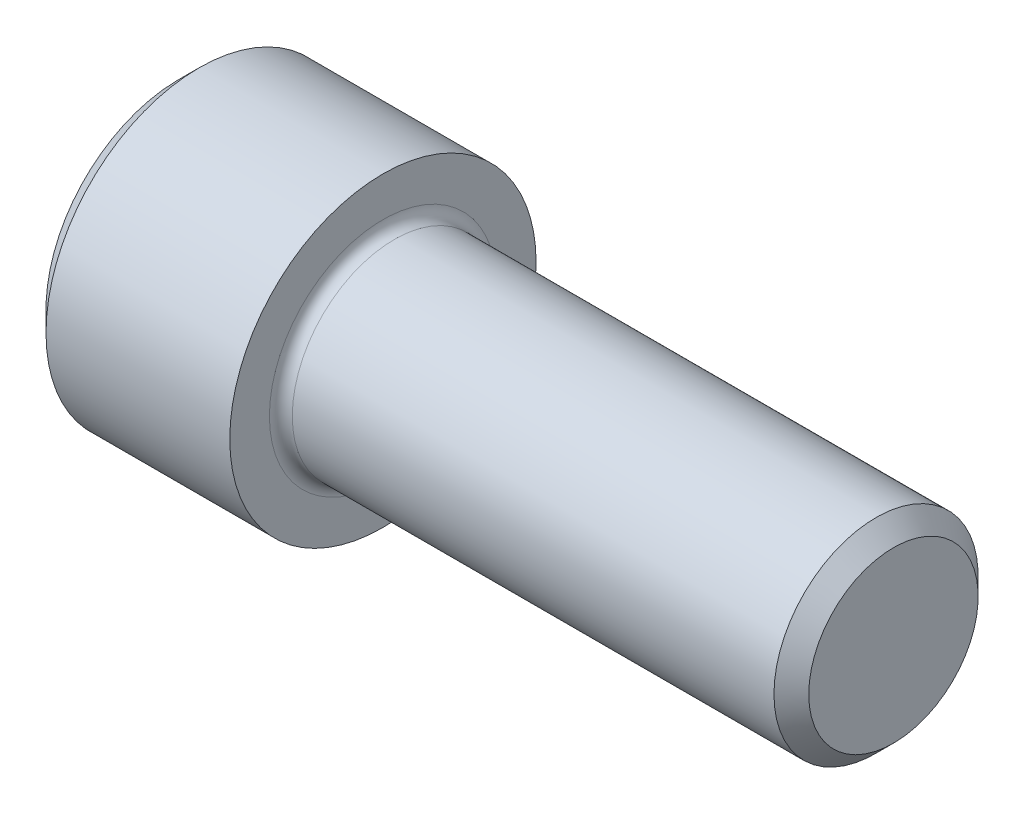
ISO-10303-21;
HEADER;
FILE_DESCRIPTION(('STEP AP214'),'2;1');
FILE_NAME('part.step','',(''),(''),'','','');
FILE_SCHEMA(('AUTOMOTIVE_DESIGN { 1 0 10303 214 1 1 1 1 }'));
ENDSEC;
DATA;
#1=APPLICATION_CONTEXT('core data for automotive mechanical design processes');
#2=APPLICATION_PROTOCOL_DEFINITION('international standard','automotive_design',2000,#1);
#3=PRODUCT_CONTEXT('',#1,'mechanical');
#4=PRODUCT('Part','Part','',(#3));
#5=PRODUCT_RELATED_PRODUCT_CATEGORY('part','',(#4));
#6=PRODUCT_DEFINITION_FORMATION('','',#4);
#7=PRODUCT_DEFINITION_CONTEXT('part definition',#1,'design');
#8=PRODUCT_DEFINITION('design','',#6,#7);
#9=PRODUCT_DEFINITION_SHAPE('','',#8);
#10=(LENGTH_UNIT() NAMED_UNIT(*) SI_UNIT(.MILLI.,.METRE.));
#11=(NAMED_UNIT(*) PLANE_ANGLE_UNIT() SI_UNIT($,.RADIAN.));
#12=(NAMED_UNIT(*) SI_UNIT($,.STERADIAN.) SOLID_ANGLE_UNIT());
#13=UNCERTAINTY_MEASURE_WITH_UNIT(LENGTH_MEASURE(1.E-05),#10,'distance_accuracy_value','');
#14=(GEOMETRIC_REPRESENTATION_CONTEXT(3) GLOBAL_UNCERTAINTY_ASSIGNED_CONTEXT((#13)) GLOBAL_UNIT_ASSIGNED_CONTEXT((#10,
#11,#12)) REPRESENTATION_CONTEXT('',''));
#15=CARTESIAN_POINT('',(0.,0.,0.));
#16=DIRECTION('',(0.,0.,1.));
#17=DIRECTION('',(1.,0.,0.));
#18=AXIS2_PLACEMENT_3D('',#15,#16,#17);
#19=CARTESIAN_POINT('',(3.048,4.12444598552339,-2.38125000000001));
#20=DIRECTION('',(1.,0.,0.));
#21=DIRECTION('',(0.,0.,-1.));
#22=AXIS2_PLACEMENT_3D('',#19,#20,#21);
#23=PLANE('',#22);
#24=DIRECTION('',(0.,1.,0.));
#25=VECTOR('',#24,1.);
#26=CARTESIAN_POINT('',(3.048,4.12444598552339,2.38125));
#27=LINE('',#26,#25);
#28=CARTESIAN_POINT('',(3.04800000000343,0.,2.38124999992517));
#29=VERTEX_POINT('',#28);
#30=CARTESIAN_POINT('',(3.048,-1.37481532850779,2.38125));
#31=VERTEX_POINT('',#30);
#32=EDGE_CURVE('E95',#29,#31,#27,.F.);
#33=ORIENTED_EDGE('',*,*,#32,.F.);
#34=CARTESIAN_POINT('',(3.04799999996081,0.,0.));
#35=DIRECTION('',(-1.,0.,0.));
#36=DIRECTION('',(0.,-1.,0.));
#37=AXIS2_PLACEMENT_3D('',#34,#35,#36);
#38=CIRCLE('',#37,2.38124999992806);
#39=CARTESIAN_POINT('',(3.04799999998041,-2.06222299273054,1.19062499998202));
#40=VERTEX_POINT('',#39);
#41=EDGE_CURVE('E97',#29,#40,#38,.F.);
#42=ORIENTED_EDGE('',*,*,#41,.T.);
#43=DIRECTION('',(0.,-0.500000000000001,-0.866025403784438));
#44=VECTOR('',#43,1.);
#45=CARTESIAN_POINT('',(3.048,-1.37481532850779,2.38125));
#46=LINE('',#45,#44);
#47=EDGE_CURVE('E100',#31,#40,#46,.T.);
#48=ORIENTED_EDGE('',*,*,#47,.F.);
#49=EDGE_LOOP('',(#33,#42,#48));
#50=FACE_BOUND('',#49,.T.);
#51=ADVANCED_FACE('F16',(#50),#23,.F.);
#52=CARTESIAN_POINT('',(3.048,4.12444598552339,-2.38125000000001));
#53=DIRECTION('',(1.,0.,0.));
#54=DIRECTION('',(0.,0.,-1.));
#55=AXIS2_PLACEMENT_3D('',#52,#53,#54);
#56=PLANE('',#55);
#57=DIRECTION('',(0.,-0.500000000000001,-0.866025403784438));
#58=VECTOR('',#57,1.);
#59=CARTESIAN_POINT('',(3.048,-2.06222299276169,1.190625));
#60=LINE('',#59,#58);
#61=CARTESIAN_POINT('',(3.048,-2.74963065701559,0.));
#62=VERTEX_POINT('',#61);
#63=EDGE_CURVE('E168',#40,#62,#60,.T.);
#64=ORIENTED_EDGE('',*,*,#63,.F.);
#65=CARTESIAN_POINT('',(3.04799999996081,0.,0.));
#66=DIRECTION('',(-1.,0.,0.));
#67=DIRECTION('',(0.,-1.,0.));
#68=AXIS2_PLACEMENT_3D('',#65,#66,#67);
#69=CIRCLE('',#68,2.38124999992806);
#70=CARTESIAN_POINT('',(3.04799999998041,-2.06222299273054,-1.19062499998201));
#71=VERTEX_POINT('',#70);
#72=EDGE_CURVE('E115',#40,#71,#69,.F.);
#73=ORIENTED_EDGE('',*,*,#72,.T.);
#74=DIRECTION('',(0.,0.499999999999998,-0.86602540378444));
#75=VECTOR('',#74,1.);
#76=CARTESIAN_POINT('',(3.048,-2.74963065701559,0.));
#77=LINE('',#76,#75);
#78=EDGE_CURVE('E164',#62,#71,#77,.T.);
#79=ORIENTED_EDGE('',*,*,#78,.F.);
#80=EDGE_LOOP('',(#64,#73,#79));
#81=FACE_BOUND('',#80,.T.);
#82=ADVANCED_FACE('F340',(#81),#56,.F.);
#83=CARTESIAN_POINT('',(3.048,4.12444598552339,-2.38125000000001));
#84=DIRECTION('',(1.,0.,0.));
#85=DIRECTION('',(0.,0.,-1.));
#86=AXIS2_PLACEMENT_3D('',#83,#84,#85);
#87=PLANE('',#86);
#88=DIRECTION('',(0.,0.499999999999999,-0.866025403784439));
#89=VECTOR('',#88,1.);
#90=CARTESIAN_POINT('',(3.048,-2.06222299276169,-1.19062499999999));
#91=LINE('',#90,#89);
#92=CARTESIAN_POINT('',(3.048,-1.3748153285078,-2.38125));
#93=VERTEX_POINT('',#92);
#94=EDGE_CURVE('E160',#71,#93,#91,.T.);
#95=ORIENTED_EDGE('',*,*,#94,.F.);
#96=CARTESIAN_POINT('',(3.04799999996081,0.,0.));
#97=DIRECTION('',(-1.,0.,0.));
#98=DIRECTION('',(0.,-1.,0.));
#99=AXIS2_PLACEMENT_3D('',#96,#97,#98);
#100=CIRCLE('',#99,2.38124999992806);
#101=CARTESIAN_POINT('',(3.04800000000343,0.,-2.38124999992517));
#102=VERTEX_POINT('',#101);
#103=EDGE_CURVE('E217',#71,#102,#100,.F.);
#104=ORIENTED_EDGE('',*,*,#103,.T.);
#105=DIRECTION('',(0.,1.,0.));
#106=VECTOR('',#105,1.);
#107=CARTESIAN_POINT('',(3.048,4.12444598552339,-2.38125));
#108=LINE('',#107,#106);
#109=EDGE_CURVE('E156',#93,#102,#108,.T.);
#110=ORIENTED_EDGE('',*,*,#109,.F.);
#111=EDGE_LOOP('',(#95,#104,#110));
#112=FACE_BOUND('',#111,.T.);
#113=ADVANCED_FACE('F337',(#112),#87,.F.);
#114=CARTESIAN_POINT('',(3.048,4.12444598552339,-2.38125000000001));
#115=DIRECTION('',(1.,0.,0.));
#116=DIRECTION('',(0.,0.,-1.));
#117=AXIS2_PLACEMENT_3D('',#114,#115,#116);
#118=PLANE('',#117);
#119=DIRECTION('',(0.,1.,0.));
#120=VECTOR('',#119,1.);
#121=CARTESIAN_POINT('',(3.048,4.12444598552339,-2.38125));
#122=LINE('',#121,#120);
#123=CARTESIAN_POINT('',(3.048,1.3748153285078,-2.38125));
#124=VERTEX_POINT('',#123);
#125=EDGE_CURVE('E152',#102,#124,#122,.T.);
#126=ORIENTED_EDGE('',*,*,#125,.F.);
#127=CARTESIAN_POINT('',(3.04799999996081,0.,0.));
#128=DIRECTION('',(-1.,0.,0.));
#129=DIRECTION('',(0.,-1.,0.));
#130=AXIS2_PLACEMENT_3D('',#127,#128,#129);
#131=CIRCLE('',#130,2.38124999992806);
#132=CARTESIAN_POINT('',(3.04799999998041,2.06222299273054,-1.19062499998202));
#133=VERTEX_POINT('',#132);
#134=EDGE_CURVE('E214',#102,#133,#131,.F.);
#135=ORIENTED_EDGE('',*,*,#134,.T.);
#136=DIRECTION('',(0.,0.500000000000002,0.866025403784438));
#137=VECTOR('',#136,1.);
#138=CARTESIAN_POINT('',(3.048,1.3748153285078,-2.38125));
#139=LINE('',#138,#137);
#140=EDGE_CURVE('E148',#124,#133,#139,.T.);
#141=ORIENTED_EDGE('',*,*,#140,.F.);
#142=EDGE_LOOP('',(#126,#135,#141));
#143=FACE_BOUND('',#142,.T.);
#144=ADVANCED_FACE('F333',(#143),#118,.F.);
#145=CARTESIAN_POINT('',(3.048,4.12444598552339,-2.38125000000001));
#146=DIRECTION('',(1.,0.,0.));
#147=DIRECTION('',(0.,0.,-1.));
#148=AXIS2_PLACEMENT_3D('',#145,#146,#147);
#149=PLANE('',#148);
#150=DIRECTION('',(0.,0.500000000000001,0.866025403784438));
#151=VECTOR('',#150,1.);
#152=CARTESIAN_POINT('',(3.048,2.0622229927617,-1.19062500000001));
#153=LINE('',#152,#151);
#154=CARTESIAN_POINT('',(3.048,2.7496306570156,0.));
#155=VERTEX_POINT('',#154);
#156=EDGE_CURVE('E144',#133,#155,#153,.T.);
#157=ORIENTED_EDGE('',*,*,#156,.F.);
#158=CARTESIAN_POINT('',(3.04799999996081,0.,0.));
#159=DIRECTION('',(-1.,0.,0.));
#160=DIRECTION('',(0.,-1.,0.));
#161=AXIS2_PLACEMENT_3D('',#158,#159,#160);
#162=CIRCLE('',#161,2.38124999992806);
#163=CARTESIAN_POINT('',(3.04799999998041,2.06222299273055,1.19062499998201));
#164=VERTEX_POINT('',#163);
#165=EDGE_CURVE('E123',#133,#164,#162,.F.);
#166=ORIENTED_EDGE('',*,*,#165,.T.);
#167=DIRECTION('',(0.,-0.499999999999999,0.866025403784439));
#168=VECTOR('',#167,1.);
#169=CARTESIAN_POINT('',(3.048,2.7496306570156,0.));
#170=LINE('',#169,#168);
#171=EDGE_CURVE('E116',#155,#164,#170,.T.);
#172=ORIENTED_EDGE('',*,*,#171,.F.);
#173=EDGE_LOOP('',(#157,#166,#172));
#174=FACE_BOUND('',#173,.T.);
#175=ADVANCED_FACE('F329',(#174),#149,.F.);
#176=CARTESIAN_POINT('',(3.04800000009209,0.,0.));
#177=DIRECTION('',(-1.,0.,0.));
#178=DIRECTION('',(0.,-1.,0.));
#179=AXIS2_PLACEMENT_3D('',#176,#177,#178);
#180=CONICAL_SURFACE('',#179,2.38124999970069,1.04719755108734);
#181=CARTESIAN_POINT('',(4.42281532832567,0.,2.27373675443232E-10));
#182=VERTEX_POINT('',#181);
#183=VERTEX_LOOP('',#182);
#184=FACE_BOUND('',#183,.T.);
#185=ORIENTED_EDGE('',*,*,#41,.F.);
#186=CARTESIAN_POINT('',(3.04799999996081,0.,0.));
#187=DIRECTION('',(-1.,0.,0.));
#188=DIRECTION('',(0.,-1.,0.));
#189=AXIS2_PLACEMENT_3D('',#186,#187,#188);
#190=CIRCLE('',#189,2.38124999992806);
#191=EDGE_CURVE('E111',#29,#164,#190,.T.);
#192=ORIENTED_EDGE('',*,*,#191,.T.);
#193=ORIENTED_EDGE('',*,*,#165,.F.);
#194=ORIENTED_EDGE('',*,*,#134,.F.);
#195=ORIENTED_EDGE('',*,*,#103,.F.);
#196=ORIENTED_EDGE('',*,*,#72,.F.);
#197=EDGE_LOOP('',(#185,#192,#193,#194,#195,#196));
#198=FACE_BOUND('',#197,.T.);
#199=ADVANCED_FACE('F109',(#184,#198),#180,.F.);
#200=CARTESIAN_POINT('',(3.048,4.12444598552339,-2.38125000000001));
#201=DIRECTION('',(1.,0.,0.));
#202=DIRECTION('',(0.,0.,-1.));
#203=AXIS2_PLACEMENT_3D('',#200,#201,#202);
#204=PLANE('',#203);
#205=DIRECTION('',(0.,0.499999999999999,-0.866025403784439));
#206=VECTOR('',#205,1.);
#207=CARTESIAN_POINT('',(3.048,2.7496306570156,0.));
#208=LINE('',#207,#206);
#209=CARTESIAN_POINT('',(3.048,1.3748153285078,2.38125));
#210=VERTEX_POINT('',#209);
#211=EDGE_CURVE('E122',#164,#210,#208,.F.);
#212=ORIENTED_EDGE('',*,*,#211,.F.);
#213=ORIENTED_EDGE('',*,*,#191,.F.);
#214=DIRECTION('',(0.,-1.,0.));
#215=VECTOR('',#214,1.);
#216=CARTESIAN_POINT('',(3.048,-1.37481532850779,2.38125));
#217=LINE('',#216,#215);
#218=EDGE_CURVE('E120',#29,#210,#217,.F.);
#219=ORIENTED_EDGE('',*,*,#218,.T.);
#220=EDGE_LOOP('',(#212,#213,#219));
#221=FACE_BOUND('',#220,.T.);
#222=ADVANCED_FACE('F119',(#221),#204,.F.);
#223=CARTESIAN_POINT('',(3.048,2.7496306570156,0.));
#224=DIRECTION('',(0.,-0.866025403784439,-0.499999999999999));
#225=DIRECTION('',(0.,0.499999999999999,-0.866025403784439));
#226=AXIS2_PLACEMENT_3D('',#223,#224,#225);
#227=PLANE('',#226);
#228=ORIENTED_EDGE('',*,*,#211,.T.);
#229=DIRECTION('',(1.,0.,0.));
#230=VECTOR('',#229,1.);
#231=CARTESIAN_POINT('',(3.048,1.3748153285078,2.38125));
#232=LINE('',#231,#230);
#233=CARTESIAN_POINT('',(0.,1.3748153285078,2.38125));
#234=VERTEX_POINT('',#233);
#235=EDGE_CURVE('E128',#210,#234,#232,.F.);
#236=ORIENTED_EDGE('',*,*,#235,.T.);
#237=DIRECTION('',(0.,-0.499999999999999,0.866025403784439));
#238=VECTOR('',#237,1.);
#239=CARTESIAN_POINT('',(0.,2.7496306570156,0.));
#240=LINE('',#239,#238);
#241=CARTESIAN_POINT('',(0.,2.7496306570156,0.));
#242=VERTEX_POINT('',#241);
#243=EDGE_CURVE('E135',#242,#234,#240,.T.);
#244=ORIENTED_EDGE('',*,*,#243,.F.);
#245=DIRECTION('',(1.,0.,0.));
#246=VECTOR('',#245,1.);
#247=CARTESIAN_POINT('',(3.048,2.7496306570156,0.));
#248=LINE('',#247,#246);
#249=EDGE_CURVE('E179',#242,#155,#248,.T.);
#250=ORIENTED_EDGE('',*,*,#249,.T.);
#251=ORIENTED_EDGE('',*,*,#171,.T.);
#252=EDGE_LOOP('',(#228,#236,#244,#250,#251));
#253=FACE_BOUND('',#252,.T.);
#254=ADVANCED_FACE('F321',(#253),#227,.T.);
#255=CARTESIAN_POINT('',(3.048,-1.37481532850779,2.38125));
#256=DIRECTION('',(0.,0.,1.));
#257=DIRECTION('',(0.,-1.,0.));
#258=AXIS2_PLACEMENT_3D('',#255,#256,#257);
#259=PLANE('',#258);
#260=ORIENTED_EDGE('',*,*,#235,.F.);
#261=ORIENTED_EDGE('',*,*,#218,.F.);
#262=ORIENTED_EDGE('',*,*,#32,.T.);
#263=DIRECTION('',(1.,0.,0.));
#264=VECTOR('',#263,1.);
#265=CARTESIAN_POINT('',(3.048,-1.37481532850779,2.38125));
#266=LINE('',#265,#264);
#267=CARTESIAN_POINT('',(0.,-1.37481532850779,2.38125));
#268=VERTEX_POINT('',#267);
#269=EDGE_CURVE('E130',#268,#31,#266,.T.);
#270=ORIENTED_EDGE('',*,*,#269,.F.);
#271=DIRECTION('',(0.,1.,0.));
#272=VECTOR('',#271,1.);
#273=CARTESIAN_POINT('',(0.,0.,2.38125));
#274=LINE('',#273,#272);
#275=EDGE_CURVE('E364',#234,#268,#274,.F.);
#276=ORIENTED_EDGE('',*,*,#275,.F.);
#277=EDGE_LOOP('',(#260,#261,#262,#270,#276));
#278=FACE_BOUND('',#277,.T.);
#279=ADVANCED_FACE('F126',(#278),#259,.F.);
#280=CARTESIAN_POINT('',(3.048,-1.37481532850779,2.38125));
#281=DIRECTION('',(0.,0.866025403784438,-0.500000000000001));
#282=DIRECTION('',(0.,0.500000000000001,0.866025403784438));
#283=AXIS2_PLACEMENT_3D('',#280,#281,#282);
#284=PLANE('',#283);
#285=ORIENTED_EDGE('',*,*,#63,.T.);
#286=DIRECTION('',(1.,0.,0.));
#287=VECTOR('',#286,1.);
#288=CARTESIAN_POINT('',(3.048,-2.74963065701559,0.));
#289=LINE('',#288,#287);
#290=CARTESIAN_POINT('',(0.,-2.74963065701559,0.));
#291=VERTEX_POINT('',#290);
#292=EDGE_CURVE('E190',#291,#62,#289,.T.);
#293=ORIENTED_EDGE('',*,*,#292,.F.);
#294=DIRECTION('',(0.,-0.500000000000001,-0.866025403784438));
#295=VECTOR('',#294,1.);
#296=CARTESIAN_POINT('',(0.,-1.37481532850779,2.38125));
#297=LINE('',#296,#295);
#298=EDGE_CURVE('E360',#268,#291,#297,.T.);
#299=ORIENTED_EDGE('',*,*,#298,.F.);
#300=ORIENTED_EDGE('',*,*,#269,.T.);
#301=ORIENTED_EDGE('',*,*,#47,.T.);
#302=EDGE_LOOP('',(#285,#293,#299,#300,#301));
#303=FACE_BOUND('',#302,.T.);
#304=ADVANCED_FACE('F314',(#303),#284,.T.);
#305=CARTESIAN_POINT('',(3.048,-2.74963065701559,0.));
#306=DIRECTION('',(0.,0.86602540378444,0.499999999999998));
#307=DIRECTION('',(0.,-0.499999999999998,0.86602540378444));
#308=AXIS2_PLACEMENT_3D('',#305,#306,#307);
#309=PLANE('',#308);
#310=ORIENTED_EDGE('',*,*,#94,.T.);
#311=DIRECTION('',(1.,0.,0.));
#312=VECTOR('',#311,1.);
#313=CARTESIAN_POINT('',(3.048,-1.3748153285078,-2.38125));
#314=LINE('',#313,#312);
#315=CARTESIAN_POINT('',(0.,-1.3748153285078,-2.38125));
#316=VERTEX_POINT('',#315);
#317=EDGE_CURVE('E183',#93,#316,#314,.F.);
#318=ORIENTED_EDGE('',*,*,#317,.T.);
#319=DIRECTION('',(0.,0.499999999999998,-0.86602540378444));
#320=VECTOR('',#319,1.);
#321=CARTESIAN_POINT('',(0.,-2.74963065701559,0.));
#322=LINE('',#321,#320);
#323=EDGE_CURVE('E353',#291,#316,#322,.T.);
#324=ORIENTED_EDGE('',*,*,#323,.F.);
#325=ORIENTED_EDGE('',*,*,#292,.T.);
#326=ORIENTED_EDGE('',*,*,#78,.T.);
#327=EDGE_LOOP('',(#310,#318,#324,#325,#326));
#328=FACE_BOUND('',#327,.T.);
#329=ADVANCED_FACE('F310',(#328),#309,.T.);
#330=CARTESIAN_POINT('',(3.048,1.3748153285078,-2.38125));
#331=DIRECTION('',(0.,0.,-1.));
#332=DIRECTION('',(0.,1.,0.));
#333=AXIS2_PLACEMENT_3D('',#330,#331,#332);
#334=PLANE('',#333);
#335=ORIENTED_EDGE('',*,*,#317,.F.);
#336=ORIENTED_EDGE('',*,*,#109,.T.);
#337=ORIENTED_EDGE('',*,*,#125,.T.);
#338=DIRECTION('',(1.,0.,0.));
#339=VECTOR('',#338,1.);
#340=CARTESIAN_POINT('',(3.048,1.3748153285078,-2.38125));
#341=LINE('',#340,#339);
#342=CARTESIAN_POINT('',(0.,1.3748153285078,-2.38125));
#343=VERTEX_POINT('',#342);
#344=EDGE_CURVE('E182',#124,#343,#341,.F.);
#345=ORIENTED_EDGE('',*,*,#344,.T.);
#346=DIRECTION('',(0.,1.,0.));
#347=VECTOR('',#346,1.);
#348=CARTESIAN_POINT('',(0.,0.,-2.38125));
#349=LINE('',#348,#347);
#350=EDGE_CURVE('E359',#316,#343,#349,.T.);
#351=ORIENTED_EDGE('',*,*,#350,.F.);
#352=EDGE_LOOP('',(#335,#336,#337,#345,#351));
#353=FACE_BOUND('',#352,.T.);
#354=ADVANCED_FACE('F306',(#353),#334,.F.);
#355=CARTESIAN_POINT('',(3.048,2.7496306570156,0.));
#356=DIRECTION('',(0.,0.866025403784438,-0.500000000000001));
#357=DIRECTION('',(0.,0.500000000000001,0.866025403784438));
#358=AXIS2_PLACEMENT_3D('',#355,#356,#357);
#359=PLANE('',#358);
#360=ORIENTED_EDGE('',*,*,#344,.F.);
#361=ORIENTED_EDGE('',*,*,#140,.T.);
#362=ORIENTED_EDGE('',*,*,#156,.T.);
#363=ORIENTED_EDGE('',*,*,#249,.F.);
#364=DIRECTION('',(0.,0.500000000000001,0.866025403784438));
#365=VECTOR('',#364,1.);
#366=CARTESIAN_POINT('',(0.,1.3748153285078,-2.38125));
#367=LINE('',#366,#365);
#368=EDGE_CURVE('E210',#343,#242,#367,.T.);
#369=ORIENTED_EDGE('',*,*,#368,.F.);
#370=EDGE_LOOP('',(#360,#361,#362,#363,#369));
#371=FACE_BOUND('',#370,.T.);
#372=ADVANCED_FACE('F302',(#371),#359,.F.);
#373=CARTESIAN_POINT('',(0.,0.,0.));
#374=DIRECTION('',(-1.,0.,0.));
#375=DIRECTION('',(0.,0.,1.));
#376=AXIS2_PLACEMENT_3D('',#373,#374,#375);
#377=PLANE('',#376);
#378=CARTESIAN_POINT('',(0.,0.,0.));
#379=DIRECTION('',(1.,0.,0.));
#380=DIRECTION('',(0.,0.,-1.));
#381=AXIS2_PLACEMENT_3D('',#378,#379,#380);
#382=CIRCLE('',#381,4.12749999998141);
#383=CARTESIAN_POINT('',(0.,0.,-4.12749999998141));
#384=VERTEX_POINT('',#383);
#385=EDGE_CURVE('E208',#384,#384,#382,.T.);
#386=ORIENTED_EDGE('',*,*,#385,.F.);
#387=EDGE_LOOP('',(#386));
#388=FACE_BOUND('',#387,.T.);
#389=ORIENTED_EDGE('',*,*,#350,.T.);
#390=ORIENTED_EDGE('',*,*,#368,.T.);
#391=ORIENTED_EDGE('',*,*,#243,.T.);
#392=ORIENTED_EDGE('',*,*,#275,.T.);
#393=ORIENTED_EDGE('',*,*,#298,.T.);
#394=ORIENTED_EDGE('',*,*,#323,.T.);
#395=EDGE_LOOP('',(#389,#390,#391,#392,#393,#394));
#396=FACE_BOUND('',#395,.T.);
#397=ADVANCED_FACE('F294',(#388,#396),#377,.T.);
#398=CARTESIAN_POINT('',(0.634999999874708,0.,0.));
#399=DIRECTION('',(1.,0.,0.));
#400=DIRECTION('',(0.,0.,-1.));
#401=AXIS2_PLACEMENT_3D('',#398,#399,#400);
#402=CONICAL_SURFACE('',#401,4.76249999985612,0.785398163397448);
#403=ORIENTED_EDGE('',*,*,#385,.T.);
#404=EDGE_LOOP('',(#403));
#405=FACE_BOUND('',#404,.T.);
#406=CARTESIAN_POINT('',(0.634999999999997,0.,0.));
#407=DIRECTION('',(-1.,0.,0.));
#408=DIRECTION('',(0.,0.,1.));
#409=AXIS2_PLACEMENT_3D('',#406,#407,#408);
#410=CIRCLE('',#409,4.7625);
#411=CARTESIAN_POINT('',(0.634999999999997,0.,4.7625));
#412=VERTEX_POINT('',#411);
#413=EDGE_CURVE('E207',#412,#412,#410,.F.);
#414=ORIENTED_EDGE('',*,*,#413,.F.);
#415=EDGE_LOOP('',(#414));
#416=FACE_BOUND('',#415,.T.);
#417=ADVANCED_FACE('F289',(#405,#416),#402,.T.);
#418=CARTESIAN_POINT('',(-31.75,0.,0.));
#419=DIRECTION('',(-1.,0.,0.));
#420=DIRECTION('',(0.,0.,1.));
#421=AXIS2_PLACEMENT_3D('',#418,#419,#420);
#422=CYLINDRICAL_SURFACE('',#421,4.7625);
#423=CARTESIAN_POINT('',(6.35,0.,0.));
#424=DIRECTION('',(-1.,0.,0.));
#425=DIRECTION('',(0.,0.,1.));
#426=AXIS2_PLACEMENT_3D('',#423,#424,#425);
#427=CIRCLE('',#426,4.7625);
#428=CARTESIAN_POINT('',(6.35,0.,4.7625));
#429=VERTEX_POINT('',#428);
#430=EDGE_CURVE('E204',#429,#429,#427,.F.);
#431=ORIENTED_EDGE('',*,*,#430,.F.);
#432=EDGE_LOOP('',(#431));
#433=FACE_BOUND('',#432,.T.);
#434=ORIENTED_EDGE('',*,*,#413,.T.);
#435=EDGE_LOOP('',(#434));
#436=FACE_BOUND('',#435,.T.);
#437=ADVANCED_FACE('F285',(#433,#436),#422,.T.);
#438=CARTESIAN_POINT('',(22.225,2.63398,0.));
#439=DIRECTION('',(1.,0.,0.));
#440=DIRECTION('',(0.,0.,-1.));
#441=AXIS2_PLACEMENT_3D('',#438,#439,#440);
#442=PLANE('',#441);
#443=CARTESIAN_POINT('',(22.2249999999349,0.,0.));
#444=DIRECTION('',(-1.,0.,0.));
#445=DIRECTION('',(0.,0.,1.));
#446=AXIS2_PLACEMENT_3D('',#443,#444,#445);
#447=CIRCLE('',#446,2.6339799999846);
#448=CARTESIAN_POINT('',(22.2249999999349,0.,2.6339799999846));
#449=VERTEX_POINT('',#448);
#450=EDGE_CURVE('E200',#449,#449,#447,.T.);
#451=ORIENTED_EDGE('',*,*,#450,.F.);
#452=EDGE_LOOP('',(#451));
#453=FACE_BOUND('',#452,.T.);
#454=ADVANCED_FACE('F243',(#453),#442,.T.);
#455=CARTESIAN_POINT('',(6.35,4.7625,0.));
#456=DIRECTION('',(1.,0.,0.));
#457=DIRECTION('',(0.,0.,-1.));
#458=AXIS2_PLACEMENT_3D('',#455,#456,#457);
#459=PLANE('',#458);
#460=ORIENTED_EDGE('',*,*,#430,.T.);
#461=EDGE_LOOP('',(#460));
#462=FACE_BOUND('',#461,.T.);
#463=CARTESIAN_POINT('',(6.35,0.,0.));
#464=DIRECTION('',(1.,0.,0.));
#465=DIRECTION('',(0.,0.,1.));
#466=AXIS2_PLACEMENT_3D('',#463,#464,#465);
#467=CIRCLE('',#466,3.53059999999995);
#468=CARTESIAN_POINT('',(6.35,0.,-3.53059999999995));
#469=VERTEX_POINT('',#468);
#470=CARTESIAN_POINT('',(6.35,0.,3.53059999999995));
#471=VERTEX_POINT('',#470);
#472=EDGE_CURVE('E203',#469,#471,#467,.F.);
#473=ORIENTED_EDGE('',*,*,#472,.T.);
#474=CARTESIAN_POINT('',(6.35,0.,0.));
#475=DIRECTION('',(1.,0.,0.));
#476=DIRECTION('',(0.,0.,-1.));
#477=AXIS2_PLACEMENT_3D('',#474,#475,#476);
#478=CIRCLE('',#477,3.53059999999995);
#479=EDGE_CURVE('E35',#471,#469,#478,.F.);
#480=ORIENTED_EDGE('',*,*,#479,.T.);
#481=EDGE_LOOP('',(#473,#480));
#482=FACE_BOUND('',#481,.T.);
#483=ADVANCED_FACE('F224',(#462,#482),#459,.T.);
#484=CARTESIAN_POINT('',(21.6839799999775,0.,0.));
#485=DIRECTION('',(-1.,0.,0.));
#486=DIRECTION('',(0.,0.,1.));
#487=AXIS2_PLACEMENT_3D('',#484,#485,#486);
#488=CONICAL_SURFACE('',#487,3.17499999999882,0.785398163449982);
#489=CARTESIAN_POINT('',(21.6839799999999,0.,0.));
#490=DIRECTION('',(-1.,0.,0.));
#491=DIRECTION('',(0.,0.,1.));
#492=AXIS2_PLACEMENT_3D('',#489,#490,#491);
#493=CIRCLE('',#492,3.17499999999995);
#494=CARTESIAN_POINT('',(21.6839799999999,0.,3.17499999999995));
#495=VERTEX_POINT('',#494);
#496=EDGE_CURVE('E27',#495,#495,#493,.T.);
#497=ORIENTED_EDGE('',*,*,#496,.F.);
#498=EDGE_LOOP('',(#497));
#499=FACE_BOUND('',#498,.T.);
#500=ORIENTED_EDGE('',*,*,#450,.T.);
#501=EDGE_LOOP('',(#500));
#502=FACE_BOUND('',#501,.T.);
#503=ADVANCED_FACE('F242',(#499,#502),#488,.T.);
#504=CARTESIAN_POINT('',(6.7056,0.,0.));
#505=DIRECTION('',(1.,0.,0.));
#506=DIRECTION('',(0.,0.,-1.));
#507=AXIS2_PLACEMENT_3D('',#504,#505,#506);
#508=TOROIDAL_SURFACE('',#507,3.53059999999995,0.3556);
#509=CARTESIAN_POINT('',(6.7056,0.,0.));
#510=DIRECTION('',(-1.,0.,0.));
#511=DIRECTION('',(0.,0.,1.));
#512=AXIS2_PLACEMENT_3D('',#509,#510,#511);
#513=CIRCLE('',#512,3.17499999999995);
#514=CARTESIAN_POINT('',(6.7056,0.,3.17499999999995));
#515=VERTEX_POINT('',#514);
#516=EDGE_CURVE('E11',#515,#515,#513,.F.);
#517=ORIENTED_EDGE('',*,*,#516,.F.);
#518=EDGE_LOOP('',(#517));
#519=FACE_BOUND('',#518,.T.);
#520=ORIENTED_EDGE('',*,*,#472,.F.);
#521=ORIENTED_EDGE('',*,*,#479,.F.);
#522=EDGE_LOOP('',(#520,#521));
#523=FACE_BOUND('',#522,.T.);
#524=ADVANCED_FACE('F221',(#519,#523),#508,.F.);
#525=CARTESIAN_POINT('',(-31.75,0.,0.));
#526=DIRECTION('',(-1.,0.,0.));
#527=DIRECTION('',(0.,0.,1.));
#528=AXIS2_PLACEMENT_3D('',#525,#526,#527);
#529=CYLINDRICAL_SURFACE('',#528,3.17499999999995);
#530=ORIENTED_EDGE('',*,*,#516,.T.);
#531=EDGE_LOOP('',(#530));
#532=FACE_BOUND('',#531,.T.);
#533=ORIENTED_EDGE('',*,*,#496,.T.);
#534=EDGE_LOOP('',(#533));
#535=FACE_BOUND('',#534,.T.);
#536=ADVANCED_FACE('F267',(#532,#535),#529,.T.);
#537=CLOSED_SHELL('',(#51,#82,#113,#144,#175,#199,#222,#254,#279,#304,#329,#354,#372,#397,#417,
#437,#454,#483,#503,#524,#536));
#538=MANIFOLD_SOLID_BREP('B1',#537);
#539=ADVANCED_BREP_SHAPE_REPRESENTATION('',(#18,#538),#14);
#540=SHAPE_DEFINITION_REPRESENTATION(#9,#539);
ENDSEC;
END-ISO-10303-21;
